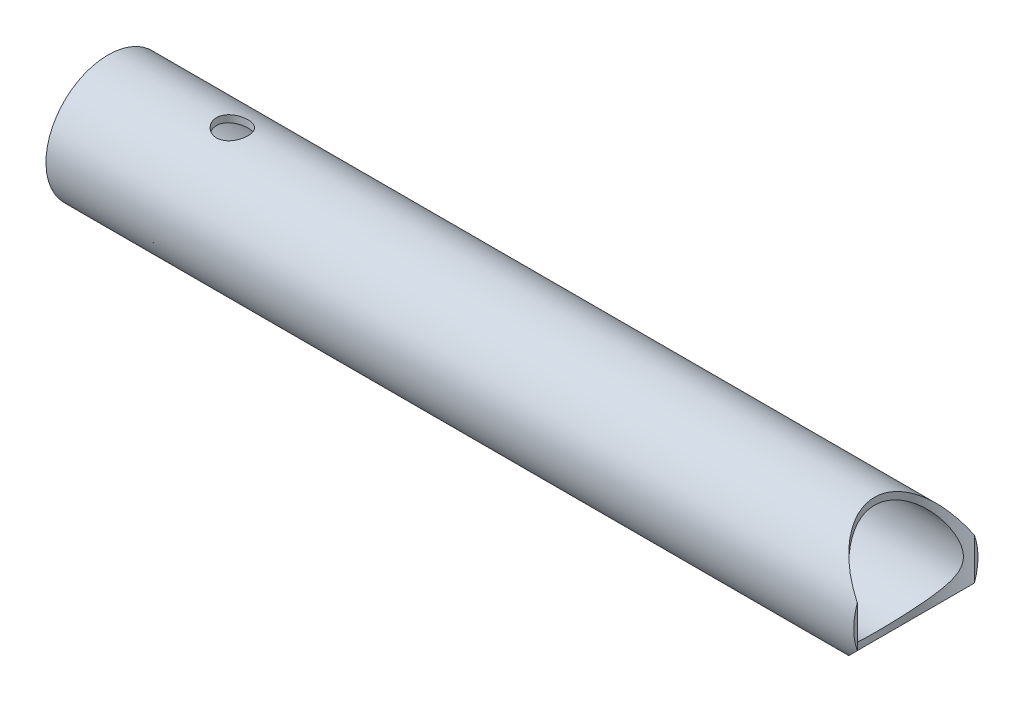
from build123d import *

# Parameters (mm, degrees)
SKETCH1_R           = 19.05
SKETCH1_R_2         = 16.9418
EXTRUDE1_DEPTH      = 123.825
EXTRUDE3_DEPTH      = 127.721882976
EXTRUDE3_DEPTH_BACK = 127.721882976
SKETCH2_R           = 19.05
EXTRUDE4_DEPTH      = 127.721883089
EXTRUDE4_DEPTH_BACK = 127.721883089
SKETCH3_R           = 4.826


with BuildPart() as part:
    # Sketch1 → Extrude1 (new, symmetric)
    with BuildSketch(Plane(origin=(0, 0, 0), x_dir=(0, 0, -1), z_dir=(1, 0, 0))):
        Circle(SKETCH1_R)
        Circle(SKETCH1_R_2, mode=Mode.SUBTRACT)
    extrude(amount=EXTRUDE1_DEPTH, both=True)

    # Sketch2 → Extrude3 (cut, two sides: drawn at the far end of the back side and taken through both)
    with BuildSketch(Plane(origin=(0, 0, 0), x_dir=(1, 0, 0), z_dir=(0, 1, 0)).offset(-EXTRUDE3_DEPTH_BACK)):
        with Locations((130.175, 0)):
            Circle(SKETCH2_R)
    extrude(amount=EXTRUDE3_DEPTH + EXTRUDE3_DEPTH_BACK, mode=Mode.SUBTRACT)

    # Sketch3 → Extrude4 (cut, two sides: drawn at the far end of the back side and taken through both)
    with BuildSketch(Plane(origin=(0, 0, 0), x_dir=(1, 0, 0), z_dir=(0, 1, 0)).offset(-EXTRUDE4_DEPTH_BACK)):
        with Locations(Location((-85.725, 0, 0), (0, 0, 270))):
            Circle(SKETCH3_R)
    extrude(amount=EXTRUDE4_DEPTH + EXTRUDE4_DEPTH_BACK, mode=Mode.SUBTRACT)


solid = part.part
